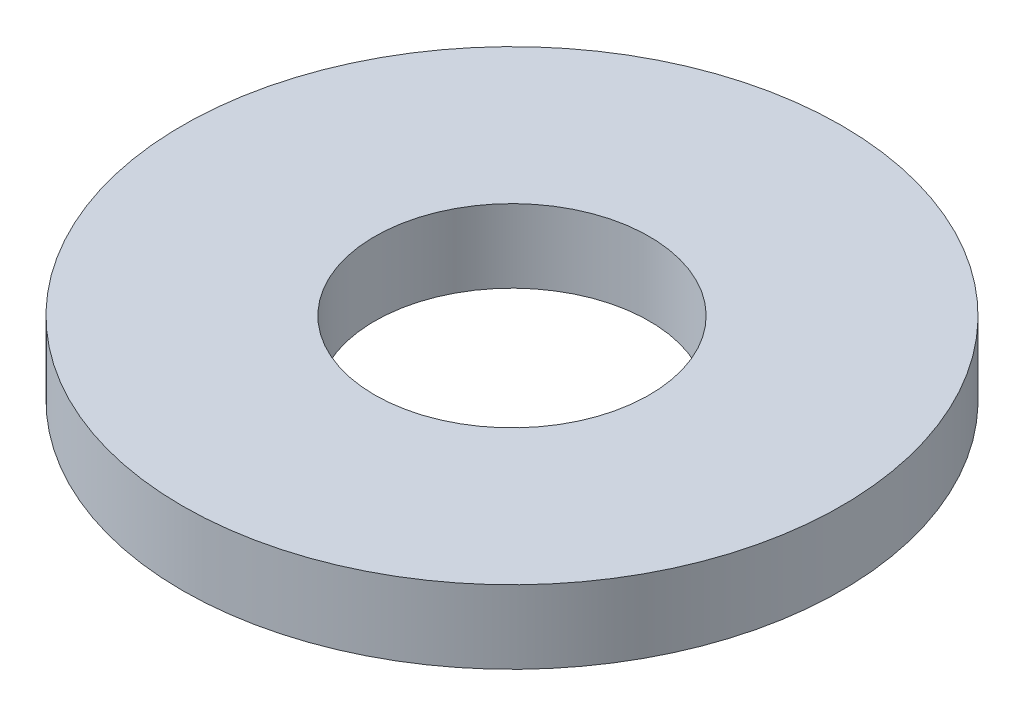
from build123d import *

# Parameters (mm, degrees)
SKETCH1_R      = 11.43
SKETCH1_R_2    = 4.7625
EXTRUDE1_DEPTH = 2.54


with BuildPart() as part:
    # Sketch1 → Extrude1 (new body)
    with BuildSketch(Plane(origin=(0, 0, 0), x_dir=(1, 0, 0), z_dir=(0, 1, 0))):
        with Locations(Location((0, 0, 0), (0, 0, 270))):
            Circle(SKETCH1_R)
        with Locations(Location((0, 0, 0), (0, 0, 270))):
            Circle(SKETCH1_R_2, mode=Mode.SUBTRACT)
    extrude(amount=EXTRUDE1_DEPTH)


solid = part.part
